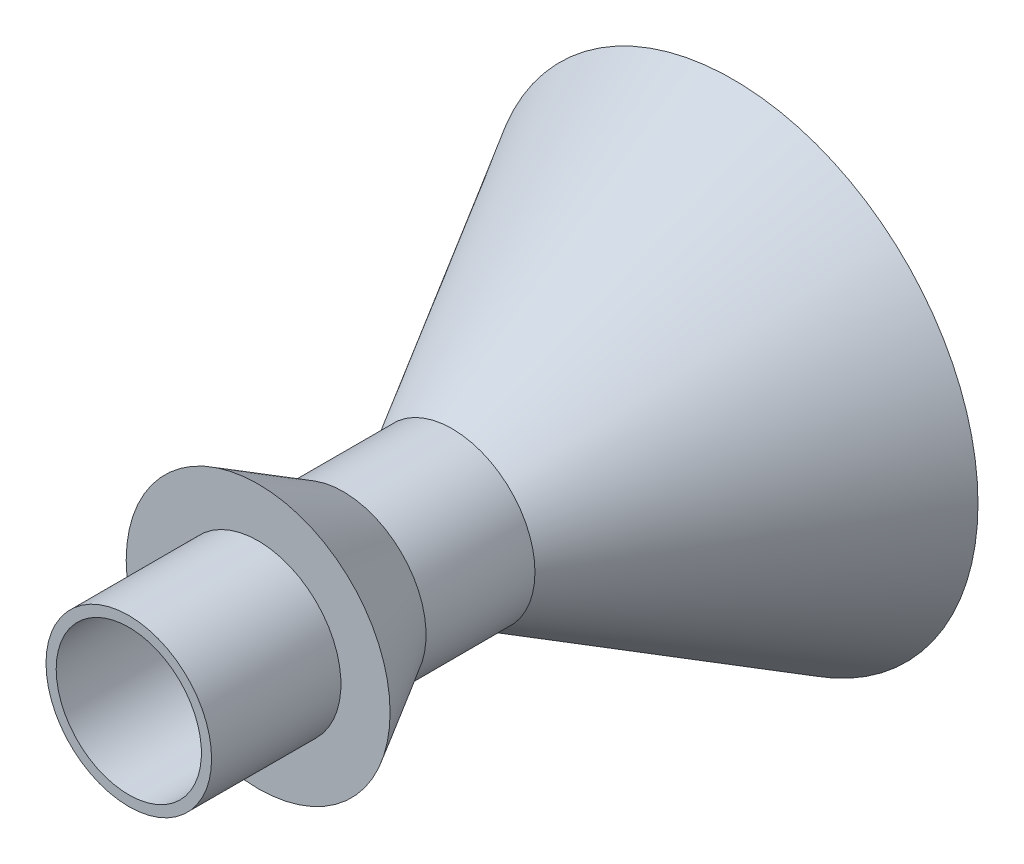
ISO-10303-21;
HEADER;
FILE_DESCRIPTION(('STEP AP214'),'2;1');
FILE_NAME('part.step','',(''),(''),'','','');
FILE_SCHEMA(('AUTOMOTIVE_DESIGN { 1 0 10303 214 1 1 1 1 }'));
ENDSEC;
DATA;
#1=APPLICATION_CONTEXT('core data for automotive mechanical design processes');
#2=APPLICATION_PROTOCOL_DEFINITION('international standard','automotive_design',2000,#1);
#3=PRODUCT_CONTEXT('',#1,'mechanical');
#4=PRODUCT('Part','Part','',(#3));
#5=PRODUCT_RELATED_PRODUCT_CATEGORY('part','',(#4));
#6=PRODUCT_DEFINITION_FORMATION('','',#4);
#7=PRODUCT_DEFINITION_CONTEXT('part definition',#1,'design');
#8=PRODUCT_DEFINITION('design','',#6,#7);
#9=PRODUCT_DEFINITION_SHAPE('','',#8);
#10=(LENGTH_UNIT() NAMED_UNIT(*) SI_UNIT(.MILLI.,.METRE.));
#11=(NAMED_UNIT(*) PLANE_ANGLE_UNIT() SI_UNIT($,.RADIAN.));
#12=(NAMED_UNIT(*) SI_UNIT($,.STERADIAN.) SOLID_ANGLE_UNIT());
#13=UNCERTAINTY_MEASURE_WITH_UNIT(LENGTH_MEASURE(1.E-05),#10,'distance_accuracy_value','');
#14=(GEOMETRIC_REPRESENTATION_CONTEXT(3) GLOBAL_UNCERTAINTY_ASSIGNED_CONTEXT((#13)) GLOBAL_UNIT_ASSIGNED_CONTEXT((#10,
#11,#12)) REPRESENTATION_CONTEXT('',''));
#15=CARTESIAN_POINT('',(0.,0.,0.));
#16=DIRECTION('',(0.,0.,1.));
#17=DIRECTION('',(1.,0.,0.));
#18=AXIS2_PLACEMENT_3D('',#15,#16,#17);
#19=CARTESIAN_POINT('',(0.,0.,63.5));
#20=DIRECTION('',(0.,0.,-1.));
#21=DIRECTION('',(-1.,0.,0.));
#22=AXIS2_PLACEMENT_3D('',#19,#20,#21);
#23=CYLINDRICAL_SURFACE('',#22,16.256);
#24=CARTESIAN_POINT('',(0.,0.,38.1));
#25=DIRECTION('',(0.,0.,-1.));
#26=DIRECTION('',(-1.,0.,0.));
#27=AXIS2_PLACEMENT_3D('',#24,#25,#26);
#28=CIRCLE('',#27,16.256);
#29=CARTESIAN_POINT('',(-16.256,0.,38.1));
#30=VERTEX_POINT('',#29);
#31=EDGE_CURVE('E55',#30,#30,#28,.T.);
#32=ORIENTED_EDGE('',*,*,#31,.F.);
#33=EDGE_LOOP('',(#32));
#34=FACE_BOUND('',#33,.T.);
#35=CARTESIAN_POINT('',(0.,0.,63.5));
#36=DIRECTION('',(0.,0.,1.));
#37=DIRECTION('',(1.,0.,0.));
#38=AXIS2_PLACEMENT_3D('',#35,#36,#37);
#39=CIRCLE('',#38,16.256);
#40=CARTESIAN_POINT('',(16.256,0.,63.5));
#41=VERTEX_POINT('',#40);
#42=EDGE_CURVE('E40',#41,#41,#39,.T.);
#43=ORIENTED_EDGE('',*,*,#42,.F.);
#44=EDGE_LOOP('',(#43));
#45=FACE_BOUND('',#44,.T.);
#46=ADVANCED_FACE('F32',(#34,#45),#23,.T.);
#47=CARTESIAN_POINT('',(0.,0.,-57.15));
#48=DIRECTION('',(0.,0.,-1.));
#49=DIRECTION('',(-1.,0.,0.));
#50=AXIS2_PLACEMENT_3D('',#47,#48,#49);
#51=CONICAL_SURFACE('',#50,49.2515678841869,0.523598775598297);
#52=CARTESIAN_POINT('',(0.,0.,0.));
#53=DIRECTION('',(0.,0.,1.));
#54=DIRECTION('',(1.,0.,0.));
#55=AXIS2_PLACEMENT_3D('',#52,#53,#54);
#56=CIRCLE('',#55,16.256);
#57=CARTESIAN_POINT('',(16.256,0.,0.));
#58=VERTEX_POINT('',#57);
#59=EDGE_CURVE('E44',#58,#58,#56,.T.);
#60=ORIENTED_EDGE('',*,*,#59,.F.);
#61=EDGE_LOOP('',(#60));
#62=FACE_BOUND('',#61,.T.);
#63=CARTESIAN_POINT('',(0.,0.,-55.15));
#64=DIRECTION('',(0.,0.,-1.));
#65=DIRECTION('',(-1.,0.,0.));
#66=AXIS2_PLACEMENT_3D('',#63,#64,#65);
#67=CIRCLE('',#66,48.0968673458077);
#68=CARTESIAN_POINT('',(-48.0968673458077,0.,-55.15));
#69=VERTEX_POINT('',#68);
#70=EDGE_CURVE('E36',#69,#69,#67,.T.);
#71=ORIENTED_EDGE('',*,*,#70,.F.);
#72=EDGE_LOOP('',(#71));
#73=FACE_BOUND('',#72,.T.);
#74=ADVANCED_FACE('F108',(#62,#73),#51,.T.);
#75=CARTESIAN_POINT('',(0.,0.,21.3822456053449));
#76=DIRECTION('',(0.,0.,-1.));
#77=DIRECTION('',(-1.,0.,0.));
#78=AXIS2_PLACEMENT_3D('',#75,#76,#77);
#79=CIRCLE('',#78,16.256);
#80=CARTESIAN_POINT('',(-16.256,0.,21.3822456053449));
#81=VERTEX_POINT('',#80);
#82=EDGE_CURVE('E61',#81,#81,#79,.T.);
#83=ORIENTED_EDGE('',*,*,#82,.T.);
#84=EDGE_LOOP('',(#83));
#85=FACE_BOUND('',#84,.T.);
#86=ORIENTED_EDGE('',*,*,#59,.T.);
#87=EDGE_LOOP('',(#86));
#88=FACE_BOUND('',#87,.T.);
#89=ADVANCED_FACE('F111',(#85,#88),#23,.T.);
#90=CARTESIAN_POINT('',(0.,0.,63.5));
#91=DIRECTION('',(0.,0.,1.));
#92=DIRECTION('',(1.,0.,0.));
#93=AXIS2_PLACEMENT_3D('',#90,#91,#92);
#94=PLANE('',#93);
#95=CARTESIAN_POINT('',(0.,0.,63.5));
#96=DIRECTION('',(0.,0.,-1.));
#97=DIRECTION('',(-1.,0.,0.));
#98=AXIS2_PLACEMENT_3D('',#95,#96,#97);
#99=CIRCLE('',#98,14.256);
#100=CARTESIAN_POINT('',(-14.256,0.,63.5));
#101=VERTEX_POINT('',#100);
#102=EDGE_CURVE('E52',#101,#101,#99,.T.);
#103=ORIENTED_EDGE('',*,*,#102,.T.);
#104=EDGE_LOOP('',(#103));
#105=FACE_BOUND('',#104,.T.);
#106=ORIENTED_EDGE('',*,*,#42,.T.);
#107=EDGE_LOOP('',(#106));
#108=FACE_BOUND('',#107,.T.);
#109=ADVANCED_FACE('F106',(#105,#108),#94,.T.);
#110=CARTESIAN_POINT('',(0.,-52.8826404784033,-55.15));
#111=DIRECTION('',(0.,0.,-1.));
#112=DIRECTION('',(-1.,0.,0.));
#113=AXIS2_PLACEMENT_3D('',#110,#111,#112);
#114=PLANE('',#113);
#115=ORIENTED_EDGE('',*,*,#70,.T.);
#116=EDGE_LOOP('',(#115));
#117=FACE_BOUND('',#116,.T.);
#118=CARTESIAN_POINT('',(0.,0.,-55.15));
#119=DIRECTION('',(0.,0.,1.));
#120=DIRECTION('',(1.,0.,0.));
#121=AXIS2_PLACEMENT_3D('',#118,#119,#120);
#122=CIRCLE('',#121,45.7874662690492);
#123=CARTESIAN_POINT('',(-45.7874662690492,0.,-55.15));
#124=VERTEX_POINT('',#123);
#125=EDGE_CURVE('E47',#124,#124,#122,.T.);
#126=ORIENTED_EDGE('',*,*,#125,.T.);
#127=EDGE_LOOP('',(#126));
#128=FACE_BOUND('',#127,.T.);
#129=ADVANCED_FACE('F102',(#117,#128),#114,.T.);
#130=CARTESIAN_POINT('',(0.,0.,63.5));
#131=DIRECTION('',(0.,0.,-1.));
#132=DIRECTION('',(-1.,0.,0.));
#133=AXIS2_PLACEMENT_3D('',#130,#131,#132);
#134=CYLINDRICAL_SURFACE('',#133,14.256);
#135=CARTESIAN_POINT('',(0.,0.,-0.535898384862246));
#136=DIRECTION('',(0.,0.,-1.));
#137=DIRECTION('',(-1.,0.,0.));
#138=AXIS2_PLACEMENT_3D('',#135,#136,#137);
#139=CIRCLE('',#138,14.256);
#140=CARTESIAN_POINT('',(-14.256,0.,-0.535898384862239));
#141=VERTEX_POINT('',#140);
#142=EDGE_CURVE('E10',#141,#141,#139,.F.);
#143=ORIENTED_EDGE('',*,*,#142,.F.);
#144=EDGE_LOOP('',(#143));
#145=FACE_BOUND('',#144,.T.);
#146=ORIENTED_EDGE('',*,*,#102,.F.);
#147=EDGE_LOOP('',(#146));
#148=FACE_BOUND('',#147,.T.);
#149=ADVANCED_FACE('F105',(#145,#148),#134,.F.);
#150=CARTESIAN_POINT('',(0.,0.,-58.15));
#151=DIRECTION('',(0.,0.,-1.));
#152=DIRECTION('',(-1.,0.,0.));
#153=AXIS2_PLACEMENT_3D('',#150,#151,#152);
#154=CONICAL_SURFACE('',#153,47.5195170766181,0.523598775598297);
#155=CARTESIAN_POINT('',(-14.256,0.,-0.535898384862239));
#156=CARTESIAN_POINT('',(-14.5844527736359,0.,-1.10479527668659));
#157=CARTESIAN_POINT('',(-14.9129055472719,0.,-1.67369216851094));
#158=CARTESIAN_POINT('',(-15.5698110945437,0.,-2.81148595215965));
#159=CARTESIAN_POINT('',(-15.8982638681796,0.,-3.380382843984));
#160=CARTESIAN_POINT('',(-16.5551694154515,0.,-4.5181766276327));
#161=CARTESIAN_POINT('',(-16.8836221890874,0.,-5.08707351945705));
#162=CARTESIAN_POINT('',(-17.5405277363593,0.,-6.22486730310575));
#163=CARTESIAN_POINT('',(-17.8689805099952,0.,-6.79376419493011));
#164=CARTESIAN_POINT('',(-18.5258860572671,0.,-7.93155797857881));
#165=CARTESIAN_POINT('',(-18.854338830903,0.,-8.50045487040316));
#166=CARTESIAN_POINT('',(-19.5112443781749,0.,-9.63824865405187));
#167=CARTESIAN_POINT('',(-19.8396971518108,0.,-10.2071455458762));
#168=CARTESIAN_POINT('',(-20.4966026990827,0.,-11.3449393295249));
#169=CARTESIAN_POINT('',(-20.8250554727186,0.,-11.9138362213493));
#170=CARTESIAN_POINT('',(-21.4819610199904,0.,-13.051630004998));
#171=CARTESIAN_POINT('',(-21.8104137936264,0.,-13.6205268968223));
#172=CARTESIAN_POINT('',(-22.4673193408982,0.,-14.758320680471));
#173=CARTESIAN_POINT('',(-22.7957721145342,0.,-15.3272175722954));
#174=CARTESIAN_POINT('',(-23.452677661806,0.,-16.4650113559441));
#175=CARTESIAN_POINT('',(-23.7811304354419,0.,-17.0339082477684));
#176=CARTESIAN_POINT('',(-24.4380359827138,0.,-18.1717020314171));
#177=CARTESIAN_POINT('',(-24.7664887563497,0.,-18.7405989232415));
#178=CARTESIAN_POINT('',(-25.4233943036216,0.,-19.8783927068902));
#179=CARTESIAN_POINT('',(-25.7518470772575,0.,-20.4472895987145));
#180=CARTESIAN_POINT('',(-26.4087526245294,0.,-21.5850833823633));
#181=CARTESIAN_POINT('',(-26.7372053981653,0.,-22.1539802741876));
#182=CARTESIAN_POINT('',(-27.3941109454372,0.,-23.2917740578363));
#183=CARTESIAN_POINT('',(-27.7225637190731,0.,-23.8606709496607));
#184=CARTESIAN_POINT('',(-28.379469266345,0.,-24.9984647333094));
#185=CARTESIAN_POINT('',(-28.7079220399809,0.,-25.5673616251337));
#186=CARTESIAN_POINT('',(-29.3648275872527,0.,-26.7051554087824));
#187=CARTESIAN_POINT('',(-29.6932803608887,0.,-27.2740523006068));
#188=CARTESIAN_POINT('',(-30.3501859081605,0.,-28.4118460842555));
#189=CARTESIAN_POINT('',(-30.6786386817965,0.,-28.9807429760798));
#190=CARTESIAN_POINT('',(-31.3355442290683,0.,-30.1185367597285));
#191=CARTESIAN_POINT('',(-31.6639970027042,0.,-30.6874336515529));
#192=CARTESIAN_POINT('',(-32.3209025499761,0.,-31.8252274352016));
#193=CARTESIAN_POINT('',(-32.649355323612,0.,-32.3941243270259));
#194=CARTESIAN_POINT('',(-33.3062608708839,0.,-33.5319181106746));
#195=CARTESIAN_POINT('',(-33.6347136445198,0.,-34.100815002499));
#196=CARTESIAN_POINT('',(-34.2916191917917,0.,-35.2386087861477));
#197=CARTESIAN_POINT('',(-34.6200719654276,0.,-35.807505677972));
#198=CARTESIAN_POINT('',(-35.2769775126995,0.,-36.9452994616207));
#199=CARTESIAN_POINT('',(-35.6054302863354,0.,-37.5141963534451));
#200=CARTESIAN_POINT('',(-36.2623358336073,0.,-38.6519901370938));
#201=CARTESIAN_POINT('',(-36.5907886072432,0.,-39.2208870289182));
#202=CARTESIAN_POINT('',(-37.247694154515,0.,-40.3586808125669));
#203=CARTESIAN_POINT('',(-37.576146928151,0.,-40.9275777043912));
#204=CARTESIAN_POINT('',(-38.2330524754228,0.,-42.0653714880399));
#205=CARTESIAN_POINT('',(-38.5615052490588,0.,-42.6342683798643));
#206=CARTESIAN_POINT('',(-39.2184107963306,0.,-43.772062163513));
#207=CARTESIAN_POINT('',(-39.5468635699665,0.,-44.3409590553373));
#208=CARTESIAN_POINT('',(-40.2037691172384,0.,-45.478752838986));
#209=CARTESIAN_POINT('',(-40.5322218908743,0.,-46.0476497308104));
#210=CARTESIAN_POINT('',(-41.1891274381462,0.,-47.1854435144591));
#211=CARTESIAN_POINT('',(-41.5175802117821,0.,-47.7543404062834));
#212=CARTESIAN_POINT('',(-42.174485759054,0.,-48.8921341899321));
#213=CARTESIAN_POINT('',(-42.5029385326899,0.,-49.4610310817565));
#214=CARTESIAN_POINT('',(-43.1598440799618,0.,-50.5988248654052));
#215=CARTESIAN_POINT('',(-43.4882968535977,0.,-51.1677217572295));
#216=CARTESIAN_POINT('',(-44.1452024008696,0.,-52.3055155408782));
#217=CARTESIAN_POINT('',(-44.4736551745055,0.,-52.8744124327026));
#218=CARTESIAN_POINT('',(-45.1305607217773,0.,-54.0122062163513));
#219=CARTESIAN_POINT('',(-45.4590134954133,0.,-54.5811031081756));
#220=CARTESIAN_POINT('',(-45.7874662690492,0.,-55.15));
#221=B_SPLINE_CURVE_WITH_KNOTS('',3,(#155,#156,#157,#158,#159,#160,#161,#162,#163,#164,#165,
#166,#167,#168,#169,#170,#171,#172,#173,#174,#175,#176,#177,#178,#179,#180,#181,#182,#183,#184,
#185,#186,#187,#188,#189,#190,#191,#192,#193,#194,#195,#196,#197,#198,#199,#200,#201,#202,#203,
#204,#205,#206,#207,#208,#209,#210,#211,#212,#213,#214,#215,#216,#217,#218,#219,#220),
.UNSPECIFIED.,.F.,.F.,(4,2,2,2,2,2,2,2,2,2,2,2,2,2,2,2,2,2,2,2,2,2,2,2,2,2,2,2,2,2,2,2,4),(0.,
1.97071664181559,3.94143328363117,5.91214992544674,7.88286656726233,9.85358320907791,
11.8242998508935,13.7950164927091,15.7657331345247,17.7364497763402,19.7071664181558,
21.6778830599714,23.648599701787,25.6193163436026,27.5900329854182,29.5607496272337,
31.5314662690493,33.5021829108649,35.4728995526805,37.4436161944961,39.4143328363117,
41.3850494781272,43.3557661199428,45.3264827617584,47.297199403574,49.2679160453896,
51.2386326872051,53.2093493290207,55.1800659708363,57.1507826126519,59.1214992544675,
61.0922158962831,63.0629325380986),.UNSPECIFIED.);
#222=EDGE_CURVE('BSEAM34',#141,#124,#221,.T.);
#223=ORIENTED_EDGE('',*,*,#142,.T.);
#224=ORIENTED_EDGE('',*,*,#125,.F.);
#225=ORIENTED_EDGE('',*,*,#222,.T.);
#226=ORIENTED_EDGE('',*,*,#222,.F.);
#227=EDGE_LOOP('',(#223,#225,#224,#226));
#228=FACE_BOUND('',#227,.T.);
#229=ADVANCED_FACE('F34',(#228),#154,.F.);
#230=CARTESIAN_POINT('',(-16.256,0.,38.1));
#231=DIRECTION('',(0.,0.,1.));
#232=DIRECTION('',(1.,0.,0.));
#233=AXIS2_PLACEMENT_3D('',#230,#231,#232);
#234=PLANE('',#233);
#235=ORIENTED_EDGE('',*,*,#31,.T.);
#236=EDGE_LOOP('',(#235));
#237=FACE_BOUND('',#236,.T.);
#238=CARTESIAN_POINT('',(0.,0.,38.1));
#239=DIRECTION('',(0.,0.,-1.));
#240=DIRECTION('',(-1.,0.,0.));
#241=AXIS2_PLACEMENT_3D('',#238,#239,#240);
#242=CIRCLE('',#241,25.908);
#243=CARTESIAN_POINT('',(-25.908,0.,38.1));
#244=VERTEX_POINT('',#243);
#245=EDGE_CURVE('E58',#244,#244,#242,.T.);
#246=ORIENTED_EDGE('',*,*,#245,.F.);
#247=EDGE_LOOP('',(#246));
#248=FACE_BOUND('',#247,.T.);
#249=ADVANCED_FACE('F97',(#237,#248),#234,.T.);
#250=CARTESIAN_POINT('',(0.,0.,21.3822456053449));
#251=DIRECTION('',(0.,0.,1.));
#252=DIRECTION('',(1.,0.,0.));
#253=AXIS2_PLACEMENT_3D('',#250,#251,#252);
#254=CONICAL_SURFACE('',#253,16.256,0.523598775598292);
#255=ORIENTED_EDGE('',*,*,#245,.T.);
#256=EDGE_LOOP('',(#255));
#257=FACE_BOUND('',#256,.T.);
#258=ORIENTED_EDGE('',*,*,#82,.F.);
#259=EDGE_LOOP('',(#258));
#260=FACE_BOUND('',#259,.T.);
#261=ADVANCED_FACE('F95',(#257,#260),#254,.T.);
#262=CLOSED_SHELL('',(#46,#74,#89,#109,#129,#149,#229,#249,#261));
#263=CARTESIAN_POINT('',(0.,16.3060119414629,36.068));
#264=DIRECTION('',(0.,0.,-1.));
#265=DIRECTION('',(-1.,0.,0.));
#266=AXIS2_PLACEMENT_3D('',#263,#264,#265);
#267=PLANE('',#266);
#268=CARTESIAN_POINT('',(0.,0.,36.068));
#269=DIRECTION('',(0.,0.,1.));
#270=DIRECTION('',(1.,0.,0.));
#271=AXIS2_PLACEMENT_3D('',#268,#269,#270);
#272=CIRCLE('',#271,16.3060119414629);
#273=CARTESIAN_POINT('',(16.3060119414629,0.,36.068));
#274=VERTEX_POINT('',#273);
#275=EDGE_CURVE('E70',#274,#274,#272,.T.);
#276=ORIENTED_EDGE('',*,*,#275,.T.);
#277=EDGE_LOOP('',(#276));
#278=FACE_BOUND('',#277,.T.);
#279=CARTESIAN_POINT('',(0.,0.,36.068));
#280=DIRECTION('',(0.,0.,1.));
#281=DIRECTION('',(1.,0.,0.));
#282=AXIS2_PLACEMENT_3D('',#279,#280,#281);
#283=CIRCLE('',#282,22.0013858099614);
#284=CARTESIAN_POINT('',(22.0013858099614,0.,36.068));
#285=VERTEX_POINT('',#284);
#286=EDGE_CURVE('E64',#285,#285,#283,.T.);
#287=ORIENTED_EDGE('',*,*,#286,.F.);
#288=EDGE_LOOP('',(#287));
#289=FACE_BOUND('',#288,.T.);
#290=ADVANCED_FACE('F74',(#278,#289),#267,.T.);
#291=CARTESIAN_POINT('',(0.,0.,25.784539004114));
#292=DIRECTION('',(0.,0.,1.));
#293=DIRECTION('',(1.,0.,0.));
#294=AXIS2_PLACEMENT_3D('',#291,#292,#293);
#295=CONICAL_SURFACE('',#294,16.3060119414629,0.505785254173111);
#296=ORIENTED_EDGE('',*,*,#286,.T.);
#297=EDGE_LOOP('',(#296));
#298=FACE_BOUND('',#297,.T.);
#299=CARTESIAN_POINT('',(0.,0.,25.784539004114));
#300=DIRECTION('',(0.,0.,1.));
#301=DIRECTION('',(1.,0.,0.));
#302=AXIS2_PLACEMENT_3D('',#299,#300,#301);
#303=CIRCLE('',#302,16.3060119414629);
#304=CARTESIAN_POINT('',(16.3060119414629,0.,25.784539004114));
#305=VERTEX_POINT('',#304);
#306=EDGE_CURVE('E67',#305,#305,#303,.T.);
#307=ORIENTED_EDGE('',*,*,#306,.F.);
#308=EDGE_LOOP('',(#307));
#309=FACE_BOUND('',#308,.T.);
#310=ADVANCED_FACE('F79',(#298,#309),#295,.F.);
#311=CARTESIAN_POINT('',(0.,0.,21.3822456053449));
#312=DIRECTION('',(0.,0.,1.));
#313=DIRECTION('',(1.,0.,0.));
#314=AXIS2_PLACEMENT_3D('',#311,#312,#313);
#315=CYLINDRICAL_SURFACE('',#314,16.3060119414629);
#316=ORIENTED_EDGE('',*,*,#306,.T.);
#317=EDGE_LOOP('',(#316));
#318=FACE_BOUND('',#317,.T.);
#319=ORIENTED_EDGE('',*,*,#275,.F.);
#320=EDGE_LOOP('',(#319));
#321=FACE_BOUND('',#320,.T.);
#322=ADVANCED_FACE('F77',(#318,#321),#315,.T.);
#323=CLOSED_SHELL('',(#290,#310,#322));
#324=ORIENTED_CLOSED_SHELL('',*,#323,.T.);
#325=BREP_WITH_VOIDS('B2',#262,(#324));
#326=ADVANCED_BREP_SHAPE_REPRESENTATION('',(#18,#325),#14);
#327=SHAPE_DEFINITION_REPRESENTATION(#9,#326);
ENDSEC;
END-ISO-10303-21;
